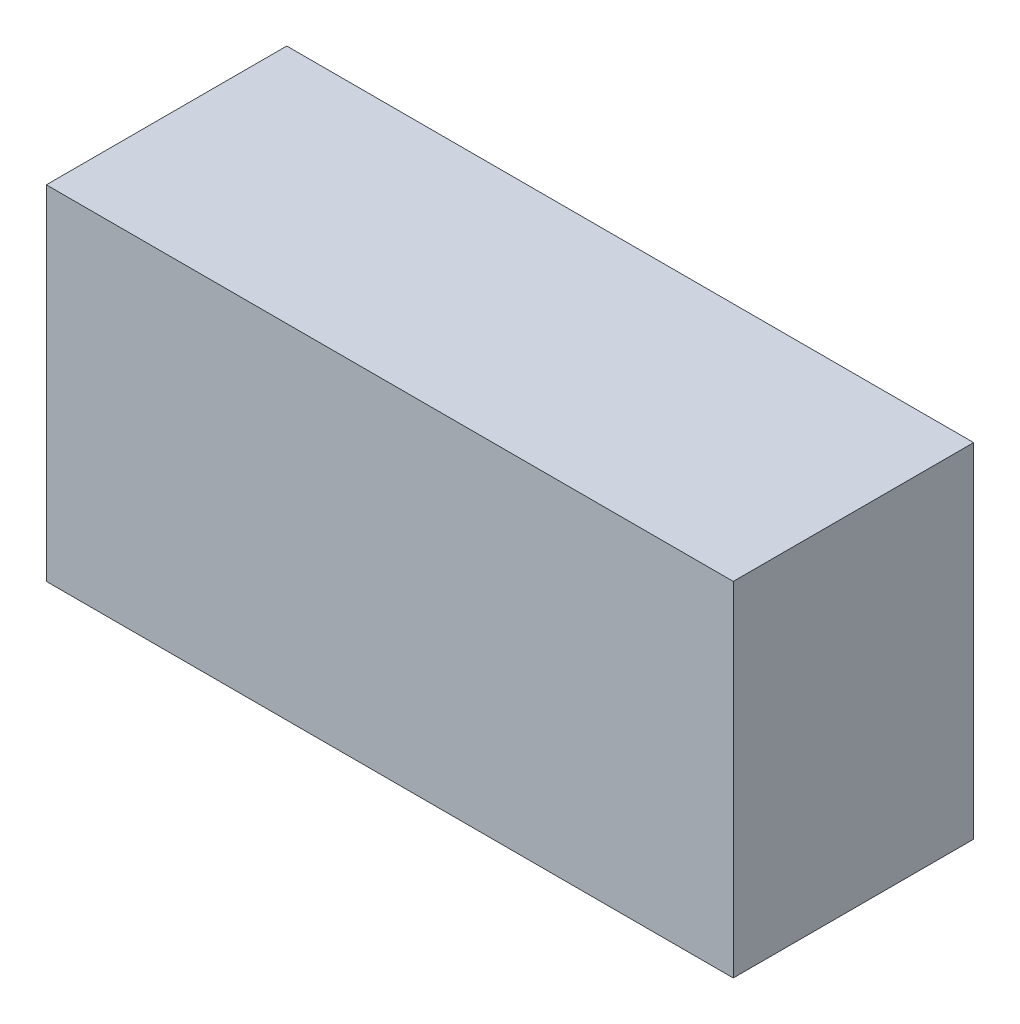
ISO-10303-21;
HEADER;
FILE_DESCRIPTION(('STEP AP214'),'2;1');
FILE_NAME('part.step','',(''),(''),'','','');
FILE_SCHEMA(('AUTOMOTIVE_DESIGN { 1 0 10303 214 1 1 1 1 }'));
ENDSEC;
DATA;
#1=APPLICATION_CONTEXT('core data for automotive mechanical design processes');
#2=APPLICATION_PROTOCOL_DEFINITION('international standard','automotive_design',2000,#1);
#3=PRODUCT_CONTEXT('',#1,'mechanical');
#4=PRODUCT('Part','Part','',(#3));
#5=PRODUCT_RELATED_PRODUCT_CATEGORY('part','',(#4));
#6=PRODUCT_DEFINITION_FORMATION('','',#4);
#7=PRODUCT_DEFINITION_CONTEXT('part definition',#1,'design');
#8=PRODUCT_DEFINITION('design','',#6,#7);
#9=PRODUCT_DEFINITION_SHAPE('','',#8);
#10=(LENGTH_UNIT() NAMED_UNIT(*) SI_UNIT(.MILLI.,.METRE.));
#11=(NAMED_UNIT(*) PLANE_ANGLE_UNIT() SI_UNIT($,.RADIAN.));
#12=(NAMED_UNIT(*) SI_UNIT($,.STERADIAN.) SOLID_ANGLE_UNIT());
#13=UNCERTAINTY_MEASURE_WITH_UNIT(LENGTH_MEASURE(1.E-05),#10,'distance_accuracy_value','');
#14=(GEOMETRIC_REPRESENTATION_CONTEXT(3) GLOBAL_UNCERTAINTY_ASSIGNED_CONTEXT((#13)) GLOBAL_UNIT_ASSIGNED_CONTEXT((#10,
#11,#12)) REPRESENTATION_CONTEXT('',''));
#15=CARTESIAN_POINT('',(0.,0.,0.));
#16=DIRECTION('',(0.,0.,1.));
#17=DIRECTION('',(1.,0.,0.));
#18=AXIS2_PLACEMENT_3D('',#15,#16,#17);
#19=CARTESIAN_POINT('',(0.,0.,35.));
#20=DIRECTION('',(1.,0.,0.));
#21=DIRECTION('',(0.,1.,0.));
#22=AXIS2_PLACEMENT_3D('',#19,#20,#21);
#23=PLANE('',#22);
#24=DIRECTION('',(0.,-1.,0.));
#25=VECTOR('',#24,1.);
#26=CARTESIAN_POINT('',(0.,0.,0.));
#27=LINE('',#26,#25);
#28=CARTESIAN_POINT('',(0.,50.,0.));
#29=VERTEX_POINT('',#28);
#30=CARTESIAN_POINT('',(0.,0.,0.));
#31=VERTEX_POINT('',#30);
#32=EDGE_CURVE('E94',#29,#31,#27,.T.);
#33=ORIENTED_EDGE('',*,*,#32,.T.);
#34=DIRECTION('',(0.,0.,-1.));
#35=VECTOR('',#34,1.);
#36=CARTESIAN_POINT('',(0.,0.,35.));
#37=LINE('',#36,#35);
#38=CARTESIAN_POINT('',(0.,0.,35.));
#39=VERTEX_POINT('',#38);
#40=EDGE_CURVE('E11',#39,#31,#37,.T.);
#41=ORIENTED_EDGE('',*,*,#40,.F.);
#42=DIRECTION('',(0.,-1.,0.));
#43=VECTOR('',#42,1.);
#44=CARTESIAN_POINT('',(0.,0.,35.));
#45=LINE('',#44,#43);
#46=CARTESIAN_POINT('',(0.,50.,35.));
#47=VERTEX_POINT('',#46);
#48=EDGE_CURVE('E82',#47,#39,#45,.T.);
#49=ORIENTED_EDGE('',*,*,#48,.F.);
#50=DIRECTION('',(0.,0.,-1.));
#51=VECTOR('',#50,1.);
#52=CARTESIAN_POINT('',(0.,50.,35.));
#53=LINE('',#52,#51);
#54=EDGE_CURVE('E90',#47,#29,#53,.T.);
#55=ORIENTED_EDGE('',*,*,#54,.T.);
#56=EDGE_LOOP('',(#33,#41,#49,#55));
#57=FACE_BOUND('',#56,.T.);
#58=ADVANCED_FACE('F31',(#57),#23,.F.);
#59=CARTESIAN_POINT('',(0.,0.,35.));
#60=DIRECTION('',(0.,1.,0.));
#61=DIRECTION('',(0.,0.,1.));
#62=AXIS2_PLACEMENT_3D('',#59,#60,#61);
#63=PLANE('',#62);
#64=DIRECTION('',(1.,0.,0.));
#65=VECTOR('',#64,1.);
#66=CARTESIAN_POINT('',(0.,0.,0.));
#67=LINE('',#66,#65);
#68=CARTESIAN_POINT('',(100.,0.,0.));
#69=VERTEX_POINT('',#68);
#70=EDGE_CURVE('E86',#31,#69,#67,.T.);
#71=ORIENTED_EDGE('',*,*,#70,.T.);
#72=DIRECTION('',(0.,0.,-1.));
#73=VECTOR('',#72,1.);
#74=CARTESIAN_POINT('',(100.,0.,35.));
#75=LINE('',#74,#73);
#76=CARTESIAN_POINT('',(100.,0.,35.));
#77=VERTEX_POINT('',#76);
#78=EDGE_CURVE('E39',#77,#69,#75,.T.);
#79=ORIENTED_EDGE('',*,*,#78,.F.);
#80=DIRECTION('',(1.,0.,0.));
#81=VECTOR('',#80,1.);
#82=CARTESIAN_POINT('',(0.,0.,35.));
#83=LINE('',#82,#81);
#84=EDGE_CURVE('E77',#39,#77,#83,.T.);
#85=ORIENTED_EDGE('',*,*,#84,.F.);
#86=ORIENTED_EDGE('',*,*,#40,.T.);
#87=EDGE_LOOP('',(#71,#79,#85,#86));
#88=FACE_BOUND('',#87,.T.);
#89=ADVANCED_FACE('F85',(#88),#63,.F.);
#90=CARTESIAN_POINT('',(100.,0.,35.));
#91=DIRECTION('',(-1.,0.,0.));
#92=DIRECTION('',(0.,-1.,0.));
#93=AXIS2_PLACEMENT_3D('',#90,#91,#92);
#94=PLANE('',#93);
#95=DIRECTION('',(0.,1.,0.));
#96=VECTOR('',#95,1.);
#97=CARTESIAN_POINT('',(100.,0.,0.));
#98=LINE('',#97,#96);
#99=CARTESIAN_POINT('',(100.,50.,0.));
#100=VERTEX_POINT('',#99);
#101=EDGE_CURVE('E64',#69,#100,#98,.T.);
#102=ORIENTED_EDGE('',*,*,#101,.T.);
#103=DIRECTION('',(0.,0.,-1.));
#104=VECTOR('',#103,1.);
#105=CARTESIAN_POINT('',(100.,50.,35.));
#106=LINE('',#105,#104);
#107=CARTESIAN_POINT('',(100.,50.,35.));
#108=VERTEX_POINT('',#107);
#109=EDGE_CURVE('E87',#108,#100,#106,.T.);
#110=ORIENTED_EDGE('',*,*,#109,.F.);
#111=DIRECTION('',(0.,1.,0.));
#112=VECTOR('',#111,1.);
#113=CARTESIAN_POINT('',(100.,0.,35.));
#114=LINE('',#113,#112);
#115=EDGE_CURVE('E80',#77,#108,#114,.T.);
#116=ORIENTED_EDGE('',*,*,#115,.F.);
#117=ORIENTED_EDGE('',*,*,#78,.T.);
#118=EDGE_LOOP('',(#102,#110,#116,#117));
#119=FACE_BOUND('',#118,.T.);
#120=ADVANCED_FACE('F88',(#119),#94,.F.);
#121=CARTESIAN_POINT('',(0.,50.,35.));
#122=DIRECTION('',(0.,-1.,0.));
#123=DIRECTION('',(0.,0.,-1.));
#124=AXIS2_PLACEMENT_3D('',#121,#122,#123);
#125=PLANE('',#124);
#126=DIRECTION('',(-1.,0.,0.));
#127=VECTOR('',#126,1.);
#128=CARTESIAN_POINT('',(0.,50.,0.));
#129=LINE('',#128,#127);
#130=EDGE_CURVE('E70',#100,#29,#129,.T.);
#131=ORIENTED_EDGE('',*,*,#130,.T.);
#132=ORIENTED_EDGE('',*,*,#54,.F.);
#133=DIRECTION('',(-1.,0.,0.));
#134=VECTOR('',#133,1.);
#135=CARTESIAN_POINT('',(0.,50.,35.));
#136=LINE('',#135,#134);
#137=EDGE_CURVE('E47',#108,#47,#136,.T.);
#138=ORIENTED_EDGE('',*,*,#137,.F.);
#139=ORIENTED_EDGE('',*,*,#109,.T.);
#140=EDGE_LOOP('',(#131,#132,#138,#139));
#141=FACE_BOUND('',#140,.T.);
#142=ADVANCED_FACE('F101',(#141),#125,.F.);
#143=CARTESIAN_POINT('',(0.,50.,35.));
#144=DIRECTION('',(0.,0.,-1.));
#145=DIRECTION('',(-1.,0.,0.));
#146=AXIS2_PLACEMENT_3D('',#143,#144,#145);
#147=PLANE('',#146);
#148=ORIENTED_EDGE('',*,*,#48,.T.);
#149=ORIENTED_EDGE('',*,*,#84,.T.);
#150=ORIENTED_EDGE('',*,*,#115,.T.);
#151=ORIENTED_EDGE('',*,*,#137,.T.);
#152=EDGE_LOOP('',(#148,#149,#150,#151));
#153=FACE_BOUND('',#152,.T.);
#154=ADVANCED_FACE('F78',(#153),#147,.F.);
#155=CARTESIAN_POINT('',(0.,50.,0.));
#156=DIRECTION('',(0.,0.,-1.));
#157=DIRECTION('',(-1.,0.,0.));
#158=AXIS2_PLACEMENT_3D('',#155,#156,#157);
#159=PLANE('',#158);
#160=ORIENTED_EDGE('',*,*,#32,.F.);
#161=ORIENTED_EDGE('',*,*,#130,.F.);
#162=ORIENTED_EDGE('',*,*,#101,.F.);
#163=ORIENTED_EDGE('',*,*,#70,.F.);
#164=EDGE_LOOP('',(#160,#161,#162,#163));
#165=FACE_BOUND('',#164,.T.);
#166=ADVANCED_FACE('F104',(#165),#159,.T.);
#167=CLOSED_SHELL('',(#58,#89,#120,#142,#154,#166));
#168=MANIFOLD_SOLID_BREP('B2',#167);
#169=ADVANCED_BREP_SHAPE_REPRESENTATION('',(#18,#168),#14);
#170=SHAPE_DEFINITION_REPRESENTATION(#9,#169);
ENDSEC;
END-ISO-10303-21;
